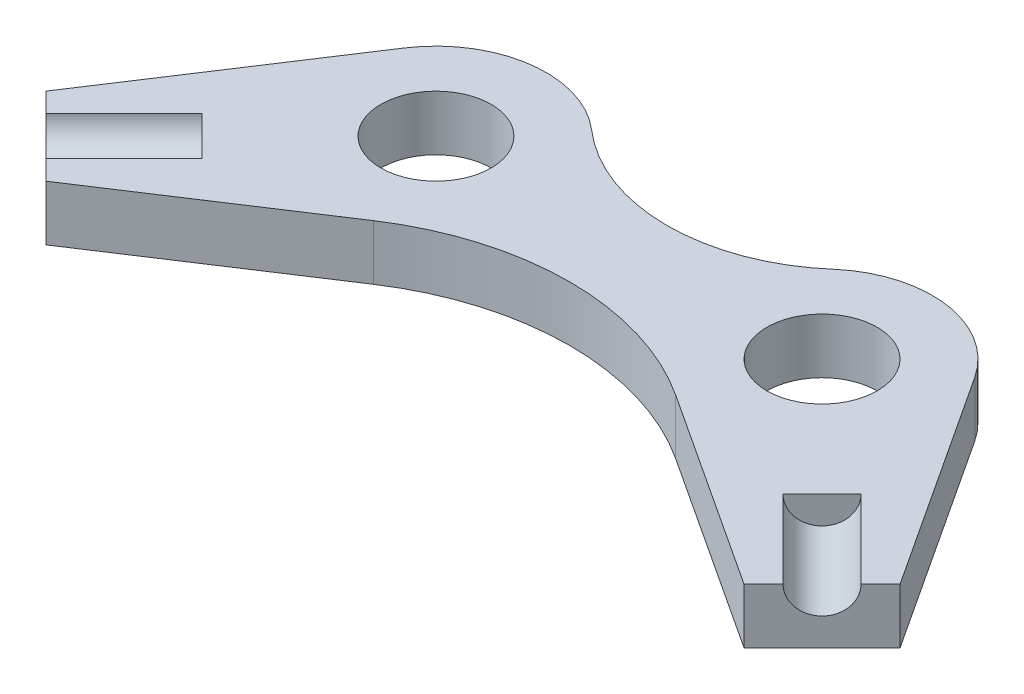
ISO-10303-21;
HEADER;
FILE_DESCRIPTION(('STEP AP214'),'2;1');
FILE_NAME('part.step','',(''),(''),'','','');
FILE_SCHEMA(('AUTOMOTIVE_DESIGN { 1 0 10303 214 1 1 1 1 }'));
ENDSEC;
DATA;
#1=APPLICATION_CONTEXT('core data for automotive mechanical design processes');
#2=APPLICATION_PROTOCOL_DEFINITION('international standard','automotive_design',2000,#1);
#3=PRODUCT_CONTEXT('',#1,'mechanical');
#4=PRODUCT('Part','Part','',(#3));
#5=PRODUCT_RELATED_PRODUCT_CATEGORY('part','',(#4));
#6=PRODUCT_DEFINITION_FORMATION('','',#4);
#7=PRODUCT_DEFINITION_CONTEXT('part definition',#1,'design');
#8=PRODUCT_DEFINITION('design','',#6,#7);
#9=PRODUCT_DEFINITION_SHAPE('','',#8);
#10=(LENGTH_UNIT() NAMED_UNIT(*) SI_UNIT(.MILLI.,.METRE.));
#11=(NAMED_UNIT(*) PLANE_ANGLE_UNIT() SI_UNIT($,.RADIAN.));
#12=(NAMED_UNIT(*) SI_UNIT($,.STERADIAN.) SOLID_ANGLE_UNIT());
#13=UNCERTAINTY_MEASURE_WITH_UNIT(LENGTH_MEASURE(1.E-05),#10,'distance_accuracy_value','');
#14=(GEOMETRIC_REPRESENTATION_CONTEXT(3) GLOBAL_UNCERTAINTY_ASSIGNED_CONTEXT((#13)) GLOBAL_UNIT_ASSIGNED_CONTEXT((#10,
#11,#12)) REPRESENTATION_CONTEXT('',''));
#15=CARTESIAN_POINT('',(0.,0.,0.));
#16=DIRECTION('',(0.,0.,1.));
#17=DIRECTION('',(1.,0.,0.));
#18=AXIS2_PLACEMENT_3D('',#15,#16,#17);
#19=CARTESIAN_POINT('',(21514.2246030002,15.,-4546.62679688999));
#20=DIRECTION('',(0.,1.,0.));
#21=DIRECTION('',(0.,0.,1.));
#22=AXIS2_PLACEMENT_3D('',#19,#20,#21);
#23=PLANE('',#22);
#24=DIRECTION('',(0.707106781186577,0.,0.707106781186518));
#25=VECTOR('',#24,1.);
#26=CARTESIAN_POINT('',(21593.2411072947,15.,-4449.14020853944));
#27=LINE('',#26,#25);
#28=CARTESIAN_POINT('',(21593.2411072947,15.,-4449.14020853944));
#29=VERTEX_POINT('',#28);
#30=CARTESIAN_POINT('',(21614.4543107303,15.,-4427.92700510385));
#31=VERTEX_POINT('',#30);
#32=EDGE_CURVE('E50',#29,#31,#27,.T.);
#33=ORIENTED_EDGE('',*,*,#32,.F.);
#34=DIRECTION('',(0.707106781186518,0.,-0.707106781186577));
#35=VECTOR('',#34,1.);
#36=CARTESIAN_POINT('',(21602.4761493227,15.,-4458.37525056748));
#37=LINE('',#36,#35);
#38=CARTESIAN_POINT('',(21603.8477090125,15.,-4459.74681025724));
#39=VERTEX_POINT('',#38);
#40=EDGE_CURVE('E11',#29,#39,#37,.T.);
#41=ORIENTED_EDGE('',*,*,#40,.T.);
#42=DIRECTION('',(0.707106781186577,0.,0.707106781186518));
#43=VECTOR('',#42,1.);
#44=CARTESIAN_POINT('',(21603.8477090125,15.,-4459.74681025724));
#45=LINE('',#44,#43);
#46=CARTESIAN_POINT('',(21625.0609124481,15.,-4438.53360682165));
#47=VERTEX_POINT('',#46);
#48=EDGE_CURVE('E136',#47,#39,#45,.F.);
#49=ORIENTED_EDGE('',*,*,#48,.F.);
#50=DIRECTION('',(0.707106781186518,0.,-0.707106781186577));
#51=VECTOR('',#50,1.);
#52=CARTESIAN_POINT('',(21609.1510098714,15.,-4422.62370424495));
#53=LINE('',#52,#51);
#54=CARTESIAN_POINT('',(21630.364213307,15.,-4443.83690768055));
#55=VERTEX_POINT('',#54);
#56=EDGE_CURVE('E189',#47,#55,#53,.T.);
#57=ORIENTED_EDGE('',*,*,#56,.T.);
#58=DIRECTION('',(-0.547803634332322,0.,-0.836606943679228));
#59=VECTOR('',#58,1.);
#60=CARTESIAN_POINT('',(21630.364213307,15.,-4443.83690768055));
#61=LINE('',#60,#59);
#62=CARTESIAN_POINT('',(21591.8228113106,15.,-4502.69742358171));
#63=VERTEX_POINT('',#62);
#64=EDGE_CURVE('E191',#55,#63,#61,.T.);
#65=ORIENTED_EDGE('',*,*,#64,.T.);
#66=CARTESIAN_POINT('',(21566.7246030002,15.,-4486.26331455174));
#67=DIRECTION('',(0.,1.,0.));
#68=DIRECTION('',(0.,0.,1.));
#69=AXIS2_PLACEMENT_3D('',#66,#67,#68);
#70=CIRCLE('',#69,29.9999999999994);
#71=CARTESIAN_POINT('',(21547.0371030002,15.,-4508.89962042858));
#72=VERTEX_POINT('',#71);
#73=EDGE_CURVE('E193',#63,#72,#70,.T.);
#74=ORIENTED_EDGE('',*,*,#73,.T.);
#75=CARTESIAN_POINT('',(21514.2246030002,15.,-4546.62679688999));
#76=DIRECTION('',(0.,-1.,0.));
#77=DIRECTION('',(0.,0.,1.));
#78=AXIS2_PLACEMENT_3D('',#75,#76,#77);
#79=CIRCLE('',#78,50.0000000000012);
#80=CARTESIAN_POINT('',(21481.4121030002,15.,-4508.89962042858));
#81=VERTEX_POINT('',#80);
#82=EDGE_CURVE('E171',#72,#81,#79,.T.);
#83=ORIENTED_EDGE('',*,*,#82,.T.);
#84=CARTESIAN_POINT('',(21461.7246030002,15.,-4486.26331455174));
#85=DIRECTION('',(0.,1.,0.));
#86=DIRECTION('',(0.,0.,1.));
#87=AXIS2_PLACEMENT_3D('',#84,#85,#86);
#88=CIRCLE('',#87,30.0000000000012);
#89=CARTESIAN_POINT('',(21436.6263946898,15.,-4502.69742358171));
#90=VERTEX_POINT('',#89);
#91=EDGE_CURVE('E174',#81,#90,#88,.T.);
#92=ORIENTED_EDGE('',*,*,#91,.T.);
#93=DIRECTION('',(-0.547803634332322,0.,0.836606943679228));
#94=VECTOR('',#93,1.);
#95=CARTESIAN_POINT('',(21398.0849926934,15.,-4443.83690768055));
#96=LINE('',#95,#94);
#97=CARTESIAN_POINT('',(21398.0849926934,15.,-4443.83690768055));
#98=VERTEX_POINT('',#97);
#99=EDGE_CURVE('E177',#90,#98,#96,.T.);
#100=ORIENTED_EDGE('',*,*,#99,.T.);
#101=DIRECTION('',(0.707106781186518,0.,0.707106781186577));
#102=VECTOR('',#101,1.);
#103=CARTESIAN_POINT('',(21419.298196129,15.,-4422.62370424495));
#104=LINE('',#103,#102);
#105=CARTESIAN_POINT('',(21403.3882935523,15.,-4438.53360682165));
#106=VERTEX_POINT('',#105);
#107=EDGE_CURVE('E180',#98,#106,#104,.T.);
#108=ORIENTED_EDGE('',*,*,#107,.T.);
#109=DIRECTION('',(-0.707106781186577,0.,0.707106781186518));
#110=VECTOR('',#109,1.);
#111=CARTESIAN_POINT('',(21424.6014969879,15.,-4459.74681025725));
#112=LINE('',#111,#110);
#113=CARTESIAN_POINT('',(21424.6014969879,15.,-4459.74681025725));
#114=VERTEX_POINT('',#113);
#115=EDGE_CURVE('E58',#114,#106,#112,.T.);
#116=ORIENTED_EDGE('',*,*,#115,.F.);
#117=DIRECTION('',(0.707106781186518,0.,0.707106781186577));
#118=VECTOR('',#117,1.);
#119=CARTESIAN_POINT('',(21425.9730566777,15.,-4458.37525056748));
#120=LINE('',#119,#118);
#121=CARTESIAN_POINT('',(21435.2080987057,15.,-4449.14020853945));
#122=VERTEX_POINT('',#121);
#123=EDGE_CURVE('E246',#114,#122,#120,.T.);
#124=ORIENTED_EDGE('',*,*,#123,.T.);
#125=DIRECTION('',(-0.707106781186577,0.,0.707106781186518));
#126=VECTOR('',#125,1.);
#127=CARTESIAN_POINT('',(21435.2080987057,15.,-4449.14020853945));
#128=LINE('',#127,#126);
#129=CARTESIAN_POINT('',(21413.9948952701,15.,-4427.92700510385));
#130=VERTEX_POINT('',#129);
#131=EDGE_CURVE('E153',#130,#122,#128,.F.);
#132=ORIENTED_EDGE('',*,*,#131,.F.);
#133=CARTESIAN_POINT('',(21419.298196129,15.,-4422.62370424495));
#134=VERTEX_POINT('',#133);
#135=EDGE_CURVE('E179',#130,#134,#104,.T.);
#136=ORIENTED_EDGE('',*,*,#135,.T.);
#137=DIRECTION('',(0.836606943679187,0.,-0.547803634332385));
#138=VECTOR('',#137,1.);
#139=CARTESIAN_POINT('',(21419.298196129,15.,-4422.62370424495));
#140=LINE('',#139,#138);
#141=CARTESIAN_POINT('',(21473.1393304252,15.,-4457.87845471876));
#142=VERTEX_POINT('',#141);
#143=EDGE_CURVE('E183',#134,#142,#140,.T.);
#144=ORIENTED_EDGE('',*,*,#143,.T.);
#145=CARTESIAN_POINT('',(21514.2246030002,15.,-4395.13293394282));
#146=DIRECTION('',(0.,-1.,0.));
#147=DIRECTION('',(0.,0.,1.));
#148=AXIS2_PLACEMENT_3D('',#145,#146,#147);
#149=CIRCLE('',#148,75.0000000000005);
#150=CARTESIAN_POINT('',(21555.3098755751,15.,-4457.87845471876));
#151=VERTEX_POINT('',#150);
#152=EDGE_CURVE('E185',#142,#151,#149,.T.);
#153=ORIENTED_EDGE('',*,*,#152,.T.);
#154=DIRECTION('',(0.836606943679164,0.,0.54780363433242));
#155=VECTOR('',#154,1.);
#156=CARTESIAN_POINT('',(21609.1510098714,15.,-4422.62370424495));
#157=LINE('',#156,#155);
#158=CARTESIAN_POINT('',(21609.1510098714,15.,-4422.62370424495));
#159=VERTEX_POINT('',#158);
#160=EDGE_CURVE('E187',#151,#159,#157,.T.);
#161=ORIENTED_EDGE('',*,*,#160,.T.);
#162=EDGE_CURVE('E149',#159,#31,#53,.T.);
#163=ORIENTED_EDGE('',*,*,#162,.T.);
#164=EDGE_LOOP('',(#33,#41,#49,#57,#65,#74,#83,#92,#100,#108,#116,#124,#132,#136,#144,#153,#161,#163));
#165=FACE_BOUND('',#164,.T.);
#166=CARTESIAN_POINT('',(21566.7246030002,15.,-4486.26331455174));
#167=DIRECTION('',(0.,1.,0.));
#168=DIRECTION('',(0.,0.,1.));
#169=AXIS2_PLACEMENT_3D('',#166,#167,#168);
#170=CIRCLE('',#169,15.0000000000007);
#171=CARTESIAN_POINT('',(21566.7246030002,15.,-4471.26331455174));
#172=VERTEX_POINT('',#171);
#173=EDGE_CURVE('E158',#172,#172,#170,.T.);
#174=ORIENTED_EDGE('',*,*,#173,.F.);
#175=EDGE_LOOP('',(#174));
#176=FACE_BOUND('',#175,.T.);
#177=CARTESIAN_POINT('',(21461.7246030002,15.,-4486.26331455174));
#178=DIRECTION('',(0.,1.,0.));
#179=DIRECTION('',(0.,0.,1.));
#180=AXIS2_PLACEMENT_3D('',#177,#178,#179);
#181=CIRCLE('',#180,15.0000000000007);
#182=CARTESIAN_POINT('',(21461.7246030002,15.,-4471.26331455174));
#183=VERTEX_POINT('',#182);
#184=EDGE_CURVE('E162',#183,#183,#181,.T.);
#185=ORIENTED_EDGE('',*,*,#184,.F.);
#186=EDGE_LOOP('',(#185));
#187=FACE_BOUND('',#186,.T.);
#188=ADVANCED_FACE('F35',(#165,#176,#187),#23,.T.);
#189=CARTESIAN_POINT('',(21514.2246030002,0.,-4546.62679688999));
#190=DIRECTION('',(0.,1.,0.));
#191=DIRECTION('',(0.,0.,1.));
#192=AXIS2_PLACEMENT_3D('',#189,#190,#191);
#193=PLANE('',#192);
#194=CARTESIAN_POINT('',(21566.7246030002,0.,-4486.26331455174));
#195=DIRECTION('',(0.,1.,0.));
#196=DIRECTION('',(0.,0.,1.));
#197=AXIS2_PLACEMENT_3D('',#194,#195,#196);
#198=CIRCLE('',#197,15.0000000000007);
#199=CARTESIAN_POINT('',(21566.7246030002,0.,-4471.26331455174));
#200=VERTEX_POINT('',#199);
#201=EDGE_CURVE('E159',#200,#200,#198,.T.);
#202=ORIENTED_EDGE('',*,*,#201,.T.);
#203=EDGE_LOOP('',(#202));
#204=FACE_BOUND('',#203,.T.);
#205=CARTESIAN_POINT('',(21461.7246030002,0.,-4486.26331455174));
#206=DIRECTION('',(0.,1.,0.));
#207=DIRECTION('',(0.,0.,1.));
#208=AXIS2_PLACEMENT_3D('',#205,#206,#207);
#209=CIRCLE('',#208,15.0000000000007);
#210=CARTESIAN_POINT('',(21461.7246030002,0.,-4471.26331455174));
#211=VERTEX_POINT('',#210);
#212=EDGE_CURVE('E165',#211,#211,#209,.T.);
#213=ORIENTED_EDGE('',*,*,#212,.T.);
#214=EDGE_LOOP('',(#213));
#215=FACE_BOUND('',#214,.T.);
#216=CARTESIAN_POINT('',(21514.2246030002,0.,-4546.62679688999));
#217=DIRECTION('',(0.,-1.,0.));
#218=DIRECTION('',(0.,0.,1.));
#219=AXIS2_PLACEMENT_3D('',#216,#217,#218);
#220=CIRCLE('',#219,50.0000000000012);
#221=CARTESIAN_POINT('',(21547.0371030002,0.,-4508.89962042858));
#222=VERTEX_POINT('',#221);
#223=CARTESIAN_POINT('',(21481.4121030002,0.,-4508.89962042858));
#224=VERTEX_POINT('',#223);
#225=EDGE_CURVE('E168',#222,#224,#220,.T.);
#226=ORIENTED_EDGE('',*,*,#225,.F.);
#227=CARTESIAN_POINT('',(21566.7246030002,0.,-4486.26331455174));
#228=DIRECTION('',(0.,1.,0.));
#229=DIRECTION('',(0.,0.,1.));
#230=AXIS2_PLACEMENT_3D('',#227,#228,#229);
#231=CIRCLE('',#230,29.9999999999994);
#232=CARTESIAN_POINT('',(21591.8228113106,0.,-4502.69742358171));
#233=VERTEX_POINT('',#232);
#234=EDGE_CURVE('E175',#233,#222,#231,.T.);
#235=ORIENTED_EDGE('',*,*,#234,.F.);
#236=DIRECTION('',(-0.547803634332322,0.,-0.836606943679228));
#237=VECTOR('',#236,1.);
#238=CARTESIAN_POINT('',(21630.364213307,0.,-4443.83690768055));
#239=LINE('',#238,#237);
#240=CARTESIAN_POINT('',(21630.364213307,0.,-4443.83690768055));
#241=VERTEX_POINT('',#240);
#242=EDGE_CURVE('E212',#241,#233,#239,.T.);
#243=ORIENTED_EDGE('',*,*,#242,.F.);
#244=DIRECTION('',(0.707106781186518,0.,-0.707106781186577));
#245=VECTOR('',#244,1.);
#246=CARTESIAN_POINT('',(21609.1510098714,0.,-4422.62370424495));
#247=LINE('',#246,#245);
#248=CARTESIAN_POINT('',(21609.1510098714,0.,-4422.62370424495));
#249=VERTEX_POINT('',#248);
#250=EDGE_CURVE('E210',#249,#241,#247,.T.);
#251=ORIENTED_EDGE('',*,*,#250,.F.);
#252=DIRECTION('',(0.836606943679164,0.,0.54780363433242));
#253=VECTOR('',#252,1.);
#254=CARTESIAN_POINT('',(21609.1510098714,0.,-4422.62370424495));
#255=LINE('',#254,#253);
#256=CARTESIAN_POINT('',(21555.3098755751,0.,-4457.87845471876));
#257=VERTEX_POINT('',#256);
#258=EDGE_CURVE('E208',#257,#249,#255,.T.);
#259=ORIENTED_EDGE('',*,*,#258,.F.);
#260=CARTESIAN_POINT('',(21514.2246030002,0.,-4395.13293394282));
#261=DIRECTION('',(0.,-1.,0.));
#262=DIRECTION('',(0.,0.,1.));
#263=AXIS2_PLACEMENT_3D('',#260,#261,#262);
#264=CIRCLE('',#263,75.0000000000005);
#265=CARTESIAN_POINT('',(21473.1393304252,0.,-4457.87845471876));
#266=VERTEX_POINT('',#265);
#267=EDGE_CURVE('E206',#266,#257,#264,.T.);
#268=ORIENTED_EDGE('',*,*,#267,.F.);
#269=DIRECTION('',(0.836606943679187,0.,-0.547803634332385));
#270=VECTOR('',#269,1.);
#271=CARTESIAN_POINT('',(21419.298196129,0.,-4422.62370424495));
#272=LINE('',#271,#270);
#273=CARTESIAN_POINT('',(21419.298196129,0.,-4422.62370424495));
#274=VERTEX_POINT('',#273);
#275=EDGE_CURVE('E204',#274,#266,#272,.T.);
#276=ORIENTED_EDGE('',*,*,#275,.F.);
#277=DIRECTION('',(0.707106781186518,0.,0.707106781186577));
#278=VECTOR('',#277,1.);
#279=CARTESIAN_POINT('',(21419.298196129,0.,-4422.62370424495));
#280=LINE('',#279,#278);
#281=CARTESIAN_POINT('',(21398.0849926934,0.,-4443.83690768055));
#282=VERTEX_POINT('',#281);
#283=EDGE_CURVE('E202',#282,#274,#280,.T.);
#284=ORIENTED_EDGE('',*,*,#283,.F.);
#285=DIRECTION('',(-0.547803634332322,0.,0.836606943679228));
#286=VECTOR('',#285,1.);
#287=CARTESIAN_POINT('',(21398.0849926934,0.,-4443.83690768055));
#288=LINE('',#287,#286);
#289=CARTESIAN_POINT('',(21436.6263946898,0.,-4502.69742358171));
#290=VERTEX_POINT('',#289);
#291=EDGE_CURVE('E200',#290,#282,#288,.T.);
#292=ORIENTED_EDGE('',*,*,#291,.F.);
#293=CARTESIAN_POINT('',(21461.7246030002,0.,-4486.26331455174));
#294=DIRECTION('',(0.,1.,0.));
#295=DIRECTION('',(0.,0.,1.));
#296=AXIS2_PLACEMENT_3D('',#293,#294,#295);
#297=CIRCLE('',#296,30.0000000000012);
#298=EDGE_CURVE('E198',#224,#290,#297,.T.);
#299=ORIENTED_EDGE('',*,*,#298,.F.);
#300=EDGE_LOOP('',(#226,#235,#243,#251,#259,#268,#276,#284,#292,#299));
#301=FACE_BOUND('',#300,.T.);
#302=ADVANCED_FACE('F294',(#204,#215,#301),#193,.F.);
#303=CARTESIAN_POINT('',(21514.2246030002,15.,-4546.62679688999));
#304=DIRECTION('',(0.,-1.,0.));
#305=DIRECTION('',(0.,0.,-1.));
#306=AXIS2_PLACEMENT_3D('',#303,#304,#305);
#307=CYLINDRICAL_SURFACE('',#306,50.0000000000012);
#308=ORIENTED_EDGE('',*,*,#225,.T.);
#309=DIRECTION('',(0.,-1.,0.));
#310=VECTOR('',#309,1.);
#311=CARTESIAN_POINT('',(21481.4121030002,15.,-4508.89962042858));
#312=LINE('',#311,#310);
#313=EDGE_CURVE('E241',#81,#224,#312,.T.);
#314=ORIENTED_EDGE('',*,*,#313,.F.);
#315=ORIENTED_EDGE('',*,*,#82,.F.);
#316=DIRECTION('',(0.,-1.,0.));
#317=VECTOR('',#316,1.);
#318=CARTESIAN_POINT('',(21547.0371030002,15.,-4508.89962042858));
#319=LINE('',#318,#317);
#320=EDGE_CURVE('E195',#72,#222,#319,.T.);
#321=ORIENTED_EDGE('',*,*,#320,.T.);
#322=EDGE_LOOP('',(#308,#314,#315,#321));
#323=FACE_BOUND('',#322,.T.);
#324=ADVANCED_FACE('F37',(#323),#307,.F.);
#325=CARTESIAN_POINT('',(21461.7246030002,15.,-4486.26331455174));
#326=DIRECTION('',(0.,-1.,0.));
#327=DIRECTION('',(0.,0.,-1.));
#328=AXIS2_PLACEMENT_3D('',#325,#326,#327);
#329=CYLINDRICAL_SURFACE('',#328,30.0000000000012);
#330=ORIENTED_EDGE('',*,*,#298,.T.);
#331=DIRECTION('',(0.,-1.,0.));
#332=VECTOR('',#331,1.);
#333=CARTESIAN_POINT('',(21436.6263946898,15.,-4502.69742358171));
#334=LINE('',#333,#332);
#335=EDGE_CURVE('E238',#90,#290,#334,.T.);
#336=ORIENTED_EDGE('',*,*,#335,.F.);
#337=ORIENTED_EDGE('',*,*,#91,.F.);
#338=ORIENTED_EDGE('',*,*,#313,.T.);
#339=EDGE_LOOP('',(#330,#336,#337,#338));
#340=FACE_BOUND('',#339,.T.);
#341=ADVANCED_FACE('F269',(#340),#329,.T.);
#342=CARTESIAN_POINT('',(21398.0849926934,15.,-4443.83690768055));
#343=DIRECTION('',(0.836606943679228,0.,0.547803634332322));
#344=DIRECTION('',(0.547803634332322,0.,-0.836606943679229));
#345=AXIS2_PLACEMENT_3D('',#342,#343,#344);
#346=PLANE('',#345);
#347=ORIENTED_EDGE('',*,*,#291,.T.);
#348=DIRECTION('',(0.,-1.,0.));
#349=VECTOR('',#348,1.);
#350=CARTESIAN_POINT('',(21398.0849926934,15.,-4443.83690768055));
#351=LINE('',#350,#349);
#352=EDGE_CURVE('E235',#98,#282,#351,.T.);
#353=ORIENTED_EDGE('',*,*,#352,.F.);
#354=ORIENTED_EDGE('',*,*,#99,.F.);
#355=ORIENTED_EDGE('',*,*,#335,.T.);
#356=EDGE_LOOP('',(#347,#353,#354,#355));
#357=FACE_BOUND('',#356,.T.);
#358=ADVANCED_FACE('F272',(#357),#346,.F.);
#359=CARTESIAN_POINT('',(21419.298196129,15.,-4422.62370424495));
#360=DIRECTION('',(0.707106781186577,0.,-0.707106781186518));
#361=DIRECTION('',(-0.707106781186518,0.,-0.707106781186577));
#362=AXIS2_PLACEMENT_3D('',#359,#360,#361);
#363=PLANE('',#362);
#364=ORIENTED_EDGE('',*,*,#135,.F.);
#365=CARTESIAN_POINT('',(21408.6915944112,15.,-4433.23030596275));
#366=DIRECTION('',(0.707106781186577,0.,-0.707106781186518));
#367=DIRECTION('',(-0.707106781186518,0.,-0.707106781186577));
#368=AXIS2_PLACEMENT_3D('',#365,#366,#367);
#369=CIRCLE('',#368,7.50000000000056);
#370=EDGE_CURVE('E244',#130,#106,#369,.T.);
#371=ORIENTED_EDGE('',*,*,#370,.T.);
#372=ORIENTED_EDGE('',*,*,#107,.F.);
#373=ORIENTED_EDGE('',*,*,#352,.T.);
#374=ORIENTED_EDGE('',*,*,#283,.T.);
#375=DIRECTION('',(0.,-1.,0.));
#376=VECTOR('',#375,1.);
#377=CARTESIAN_POINT('',(21419.298196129,15.,-4422.62370424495));
#378=LINE('',#377,#376);
#379=EDGE_CURVE('E232',#134,#274,#378,.T.);
#380=ORIENTED_EDGE('',*,*,#379,.F.);
#381=EDGE_LOOP('',(#364,#371,#372,#373,#374,#380));
#382=FACE_BOUND('',#381,.T.);
#383=ADVANCED_FACE('F277',(#382),#363,.F.);
#384=CARTESIAN_POINT('',(21419.298196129,15.,-4422.62370424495));
#385=DIRECTION('',(-0.547803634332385,0.,-0.836606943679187));
#386=DIRECTION('',(-0.836606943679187,0.,0.547803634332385));
#387=AXIS2_PLACEMENT_3D('',#384,#385,#386);
#388=PLANE('',#387);
#389=ORIENTED_EDGE('',*,*,#275,.T.);
#390=DIRECTION('',(0.,-1.,0.));
#391=VECTOR('',#390,1.);
#392=CARTESIAN_POINT('',(21473.1393304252,15.,-4457.87845471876));
#393=LINE('',#392,#391);
#394=EDGE_CURVE('E229',#142,#266,#393,.T.);
#395=ORIENTED_EDGE('',*,*,#394,.F.);
#396=ORIENTED_EDGE('',*,*,#143,.F.);
#397=ORIENTED_EDGE('',*,*,#379,.T.);
#398=EDGE_LOOP('',(#389,#395,#396,#397));
#399=FACE_BOUND('',#398,.T.);
#400=ADVANCED_FACE('F317',(#399),#388,.F.);
#401=CARTESIAN_POINT('',(21514.2246030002,15.,-4395.13293394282));
#402=DIRECTION('',(0.,-1.,0.));
#403=DIRECTION('',(0.,0.,-1.));
#404=AXIS2_PLACEMENT_3D('',#401,#402,#403);
#405=CYLINDRICAL_SURFACE('',#404,75.0000000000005);
#406=ORIENTED_EDGE('',*,*,#267,.T.);
#407=DIRECTION('',(0.,-1.,0.));
#408=VECTOR('',#407,1.);
#409=CARTESIAN_POINT('',(21555.3098755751,15.,-4457.87845471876));
#410=LINE('',#409,#408);
#411=EDGE_CURVE('E226',#151,#257,#410,.T.);
#412=ORIENTED_EDGE('',*,*,#411,.F.);
#413=ORIENTED_EDGE('',*,*,#152,.F.);
#414=ORIENTED_EDGE('',*,*,#394,.T.);
#415=EDGE_LOOP('',(#406,#412,#413,#414));
#416=FACE_BOUND('',#415,.T.);
#417=ADVANCED_FACE('F313',(#416),#405,.F.);
#418=CARTESIAN_POINT('',(21609.1510098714,15.,-4422.62370424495));
#419=DIRECTION('',(0.54780363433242,0.,-0.836606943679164));
#420=DIRECTION('',(-0.836606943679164,0.,-0.54780363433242));
#421=AXIS2_PLACEMENT_3D('',#418,#419,#420);
#422=PLANE('',#421);
#423=ORIENTED_EDGE('',*,*,#258,.T.);
#424=DIRECTION('',(0.,-1.,0.));
#425=VECTOR('',#424,1.);
#426=CARTESIAN_POINT('',(21609.1510098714,15.,-4422.62370424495));
#427=LINE('',#426,#425);
#428=EDGE_CURVE('E223',#159,#249,#427,.T.);
#429=ORIENTED_EDGE('',*,*,#428,.F.);
#430=ORIENTED_EDGE('',*,*,#160,.F.);
#431=ORIENTED_EDGE('',*,*,#411,.T.);
#432=EDGE_LOOP('',(#423,#429,#430,#431));
#433=FACE_BOUND('',#432,.T.);
#434=ADVANCED_FACE('F310',(#433),#422,.F.);
#435=CARTESIAN_POINT('',(21609.1510098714,15.,-4422.62370424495));
#436=DIRECTION('',(-0.707106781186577,0.,-0.707106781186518));
#437=DIRECTION('',(-0.707106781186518,0.,0.707106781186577));
#438=AXIS2_PLACEMENT_3D('',#435,#436,#437);
#439=PLANE('',#438);
#440=ORIENTED_EDGE('',*,*,#56,.F.);
#441=CARTESIAN_POINT('',(21619.7576115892,15.,-4433.23030596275));
#442=DIRECTION('',(-0.707106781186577,0.,-0.707106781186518));
#443=DIRECTION('',(-0.707106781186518,0.,0.707106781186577));
#444=AXIS2_PLACEMENT_3D('',#441,#442,#443);
#445=CIRCLE('',#444,7.49999999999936);
#446=EDGE_CURVE('E43',#47,#31,#445,.T.);
#447=ORIENTED_EDGE('',*,*,#446,.T.);
#448=ORIENTED_EDGE('',*,*,#162,.F.);
#449=ORIENTED_EDGE('',*,*,#428,.T.);
#450=ORIENTED_EDGE('',*,*,#250,.T.);
#451=DIRECTION('',(0.,-1.,0.));
#452=VECTOR('',#451,1.);
#453=CARTESIAN_POINT('',(21630.364213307,15.,-4443.83690768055));
#454=LINE('',#453,#452);
#455=EDGE_CURVE('E220',#55,#241,#454,.T.);
#456=ORIENTED_EDGE('',*,*,#455,.F.);
#457=EDGE_LOOP('',(#440,#447,#448,#449,#450,#456));
#458=FACE_BOUND('',#457,.T.);
#459=ADVANCED_FACE('F249',(#458),#439,.F.);
#460=CARTESIAN_POINT('',(21630.364213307,15.,-4443.83690768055));
#461=DIRECTION('',(-0.836606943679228,0.,0.547803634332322));
#462=DIRECTION('',(0.547803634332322,0.,0.836606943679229));
#463=AXIS2_PLACEMENT_3D('',#460,#461,#462);
#464=PLANE('',#463);
#465=ORIENTED_EDGE('',*,*,#242,.T.);
#466=DIRECTION('',(0.,-1.,0.));
#467=VECTOR('',#466,1.);
#468=CARTESIAN_POINT('',(21591.8228113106,15.,-4502.69742358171));
#469=LINE('',#468,#467);
#470=EDGE_CURVE('E217',#63,#233,#469,.T.);
#471=ORIENTED_EDGE('',*,*,#470,.F.);
#472=ORIENTED_EDGE('',*,*,#64,.F.);
#473=ORIENTED_EDGE('',*,*,#455,.T.);
#474=EDGE_LOOP('',(#465,#471,#472,#473));
#475=FACE_BOUND('',#474,.T.);
#476=ADVANCED_FACE('F256',(#475),#464,.F.);
#477=CARTESIAN_POINT('',(21566.7246030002,15.,-4486.26331455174));
#478=DIRECTION('',(0.,-1.,0.));
#479=DIRECTION('',(0.,0.,-1.));
#480=AXIS2_PLACEMENT_3D('',#477,#478,#479);
#481=CYLINDRICAL_SURFACE('',#480,29.9999999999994);
#482=ORIENTED_EDGE('',*,*,#234,.T.);
#483=ORIENTED_EDGE('',*,*,#320,.F.);
#484=ORIENTED_EDGE('',*,*,#73,.F.);
#485=ORIENTED_EDGE('',*,*,#470,.T.);
#486=EDGE_LOOP('',(#482,#483,#484,#485));
#487=FACE_BOUND('',#486,.T.);
#488=ADVANCED_FACE('F260',(#487),#481,.T.);
#489=CARTESIAN_POINT('',(21461.7246030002,0.,-4486.26331455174));
#490=DIRECTION('',(0.,1.,0.));
#491=DIRECTION('',(0.,0.,1.));
#492=AXIS2_PLACEMENT_3D('',#489,#490,#491);
#493=CYLINDRICAL_SURFACE('',#492,15.0000000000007);
#494=ORIENTED_EDGE('',*,*,#212,.F.);
#495=EDGE_LOOP('',(#494));
#496=FACE_BOUND('',#495,.T.);
#497=ORIENTED_EDGE('',*,*,#184,.T.);
#498=EDGE_LOOP('',(#497));
#499=FACE_BOUND('',#498,.T.);
#500=ADVANCED_FACE('F290',(#496,#499),#493,.F.);
#501=CARTESIAN_POINT('',(21566.7246030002,0.,-4486.26331455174));
#502=DIRECTION('',(0.,1.,0.));
#503=DIRECTION('',(0.,0.,1.));
#504=AXIS2_PLACEMENT_3D('',#501,#502,#503);
#505=CYLINDRICAL_SURFACE('',#504,15.0000000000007);
#506=ORIENTED_EDGE('',*,*,#201,.F.);
#507=EDGE_LOOP('',(#506));
#508=FACE_BOUND('',#507,.T.);
#509=ORIENTED_EDGE('',*,*,#173,.T.);
#510=EDGE_LOOP('',(#509));
#511=FACE_BOUND('',#510,.T.);
#512=ADVANCED_FACE('F283',(#508,#511),#505,.F.);
#513=CARTESIAN_POINT('',(21429.9047978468,15.,-4454.44350939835));
#514=DIRECTION('',(-0.707106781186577,0.,0.707106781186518));
#515=DIRECTION('',(0.707106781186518,0.,0.707106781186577));
#516=AXIS2_PLACEMENT_3D('',#513,#514,#515);
#517=CYLINDRICAL_SURFACE('',#516,7.50000000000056);
#518=ORIENTED_EDGE('',*,*,#115,.T.);
#519=ORIENTED_EDGE('',*,*,#370,.F.);
#520=ORIENTED_EDGE('',*,*,#131,.T.);
#521=CARTESIAN_POINT('',(21429.9047978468,15.,-4454.44350939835));
#522=DIRECTION('',(-0.707106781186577,0.,0.707106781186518));
#523=DIRECTION('',(0.707106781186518,0.,0.707106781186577));
#524=AXIS2_PLACEMENT_3D('',#521,#522,#523);
#525=CIRCLE('',#524,7.50000000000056);
#526=EDGE_CURVE('E150',#114,#122,#525,.T.);
#527=ORIENTED_EDGE('',*,*,#526,.F.);
#528=EDGE_LOOP('',(#518,#519,#520,#527));
#529=FACE_BOUND('',#528,.T.);
#530=ADVANCED_FACE('F281',(#529),#517,.F.);
#531=CARTESIAN_POINT('',(21429.9047978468,15.,-4454.44350939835));
#532=DIRECTION('',(-0.707106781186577,0.,0.707106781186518));
#533=DIRECTION('',(0.707106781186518,0.,0.707106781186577));
#534=AXIS2_PLACEMENT_3D('',#531,#532,#533);
#535=PLANE('',#534);
#536=ORIENTED_EDGE('',*,*,#526,.T.);
#537=ORIENTED_EDGE('',*,*,#123,.F.);
#538=EDGE_LOOP('',(#536,#537));
#539=FACE_BOUND('',#538,.T.);
#540=ADVANCED_FACE('F280',(#539),#535,.T.);
#541=CARTESIAN_POINT('',(21598.5444081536,15.,-4454.44350939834));
#542=DIRECTION('',(0.707106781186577,0.,0.707106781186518));
#543=DIRECTION('',(0.707106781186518,0.,-0.707106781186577));
#544=AXIS2_PLACEMENT_3D('',#541,#542,#543);
#545=CYLINDRICAL_SURFACE('',#544,7.49999999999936);
#546=ORIENTED_EDGE('',*,*,#32,.T.);
#547=ORIENTED_EDGE('',*,*,#446,.F.);
#548=ORIENTED_EDGE('',*,*,#48,.T.);
#549=CARTESIAN_POINT('',(21598.5444081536,15.,-4454.44350939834));
#550=DIRECTION('',(0.707106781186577,0.,0.707106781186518));
#551=DIRECTION('',(0.707106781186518,0.,-0.707106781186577));
#552=AXIS2_PLACEMENT_3D('',#549,#550,#551);
#553=CIRCLE('',#552,7.49999999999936);
#554=EDGE_CURVE('E139',#29,#39,#553,.T.);
#555=ORIENTED_EDGE('',*,*,#554,.F.);
#556=EDGE_LOOP('',(#546,#547,#548,#555));
#557=FACE_BOUND('',#556,.T.);
#558=ADVANCED_FACE('F138',(#557),#545,.F.);
#559=CARTESIAN_POINT('',(21598.5444081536,15.,-4454.44350939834));
#560=DIRECTION('',(0.707106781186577,0.,0.707106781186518));
#561=DIRECTION('',(0.707106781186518,0.,-0.707106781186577));
#562=AXIS2_PLACEMENT_3D('',#559,#560,#561);
#563=PLANE('',#562);
#564=ORIENTED_EDGE('',*,*,#554,.T.);
#565=ORIENTED_EDGE('',*,*,#40,.F.);
#566=EDGE_LOOP('',(#564,#565));
#567=FACE_BOUND('',#566,.T.);
#568=ADVANCED_FACE('F144',(#567),#563,.T.);
#569=CLOSED_SHELL('',(#188,#302,#324,#341,#358,#383,#400,#417,#434,#459,#476,#488,#500,#512,
#530,#540,#558,#568));
#570=MANIFOLD_SOLID_BREP('B2',#569);
#571=ADVANCED_BREP_SHAPE_REPRESENTATION('',(#18,#570),#14);
#572=SHAPE_DEFINITION_REPRESENTATION(#9,#571);
ENDSEC;
END-ISO-10303-21;
